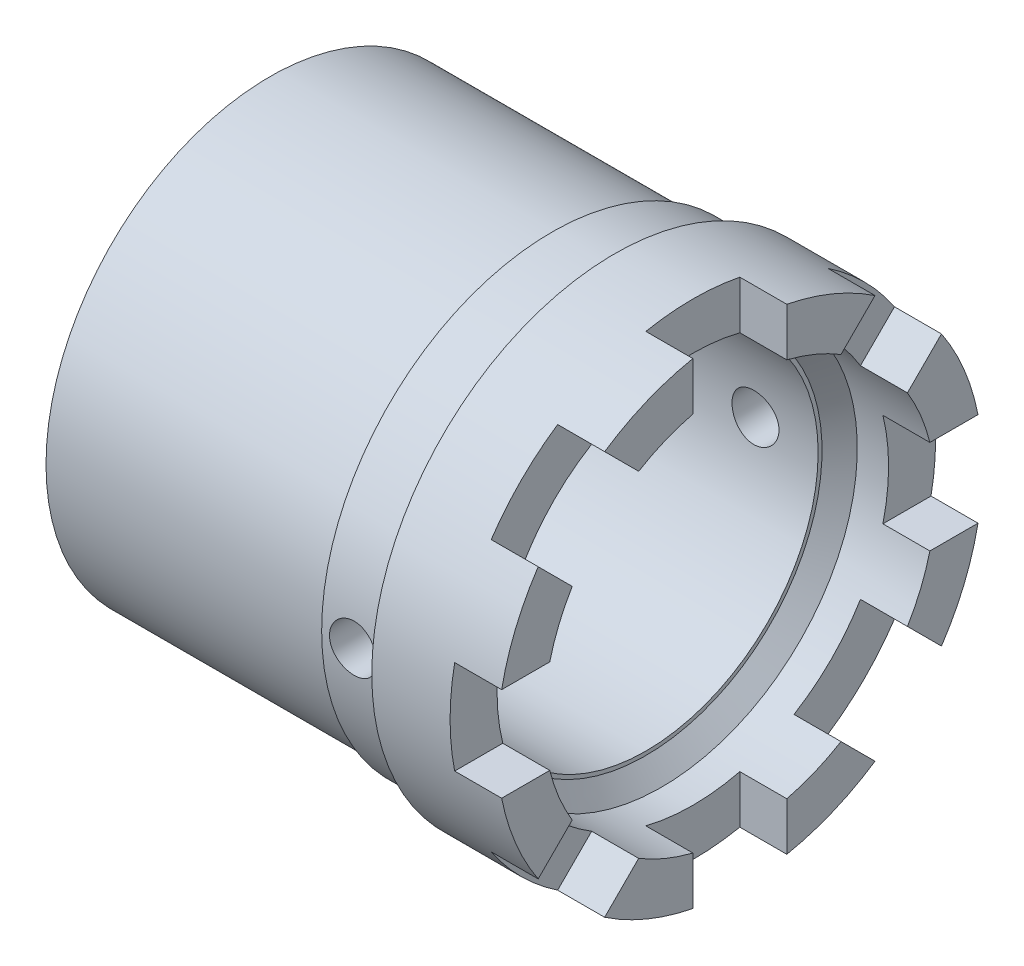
from build123d import *

# Parameters (mm, degrees)
ESQUISSE2_W                  = 6
ESQUISSE2_H                  = 7
ENL_V_MAT_EXTRU_1_DEPTH      = 3
R_P_TITION_CIRCULAIRE1_COUNT = 8
ESQUISSE3_R                  = 1.5
ENL_V_MAT_EXTRU_2_DEPTH      = 50.563091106


with BuildPart() as part:
    # Esquisse1 → Base-R_volution (revolve)
    with BuildSketch(Plane.XY, mode=Mode.PRIVATE) as base_r_volution_sk:
        Polygon((-24, 11), (0, 11), (0, 11.25), (1, 12.5), (6, 12.5), (6, 15.5), (-2, 15.5), (-2.5, 14.7), (-6, 14.7), (-6, 14.3), (-24, 14.3), align=None)
    revolve(base_r_volution_sk.sketch.rotate(Axis((0, 0, 0), (1, 0, 0)), 90), axis=Axis((0, 0, 0), (1, 0, 0)))

    # Esquisse2 → Enl_v. mat.-Extru.1 (cut)
    with BuildSketch(Plane(origin=(6, 0, 0), x_dir=(0, 0, -1), z_dir=(1, 0, 0))):
        with Locations((0, 13.5)):
            Rectangle(ESQUISSE2_W, ESQUISSE2_H)
    enl_v_mat_extru_1 = extrude(amount=-ENL_V_MAT_EXTRU_1_DEPTH, mode=Mode.SUBTRACT)

    # R_p_tition circulaire1: Enl_v. mat.-Extru.1 ×8 about axis
    r_p_tition_circulaire1_axis = Axis((0, 0, 0), (1, 0, 0))
    for i in range(1, R_P_TITION_CIRCULAIRE1_COUNT):
        add(enl_v_mat_extru_1.rotate(r_p_tition_circulaire1_axis, i * 360 / R_P_TITION_CIRCULAIRE1_COUNT), mode=Mode.SUBTRACT)

    # Esquisse3 → Enl_v. mat.-Extru.2 (cut, through all)
    with BuildSketch(Plane.XY.offset(25)):
        with Locations((-4, 0)):
            Circle(ESQUISSE3_R)
    extrude(amount=-ENL_V_MAT_EXTRU_2_DEPTH, mode=Mode.SUBTRACT)


solid = part.part
